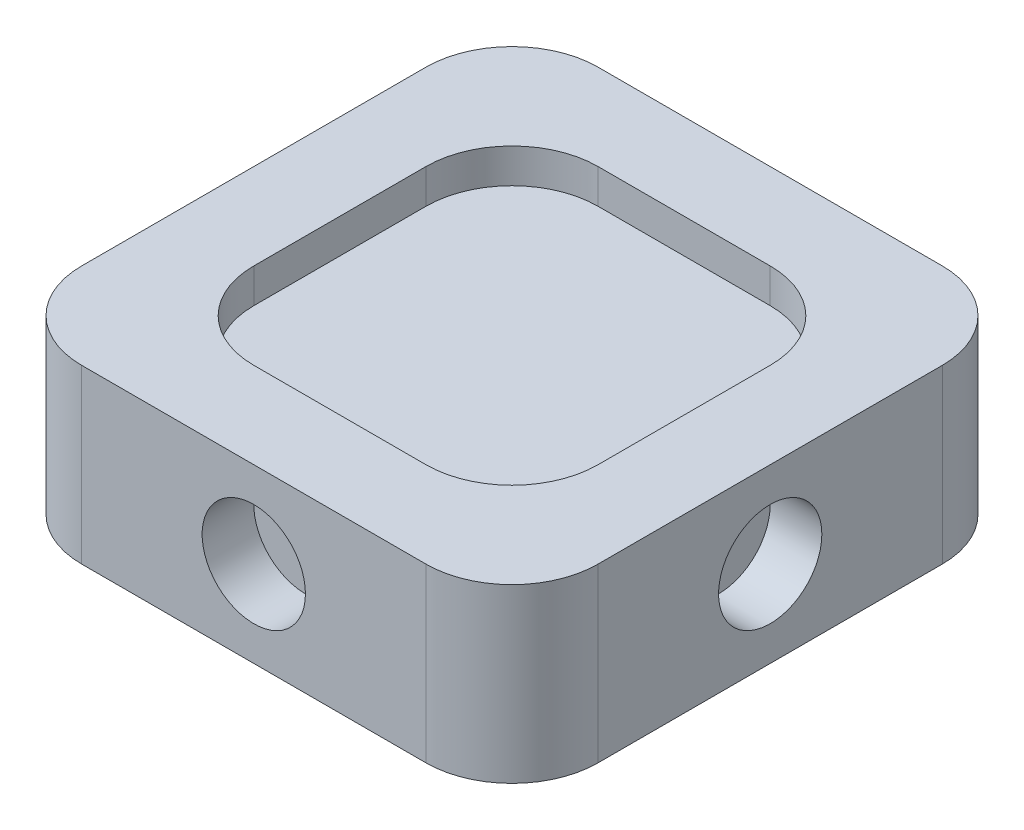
from build123d import *

# Parameters (mm, degrees)
SKETCH2_W           = 30
SKETCH2_H           = 30
BOSS_EXTRUDE1_DEPTH = 10
SKETCH3_R           = 3
CUT_EXTRUDE1_DEPTH  = 3
SKETCH4_R           = 3
CUT_EXTRUDE2_DEPTH  = 3
CUT_EXTRUDE3_START  = -3
SKETCH5_R           = 3
CUT_EXTRUDE3_DEPTH  = 3
CUT_EXTRUDE4_START  = -3
SKETCH6_R           = 3
CUT_EXTRUDE4_DEPTH  = 3
FILLET1_R           = 5
SKETCH8_W           = 20
SKETCH8_H           = 20
CUT_EXTRUDE6_DEPTH  = 2
FILLET2_R           = 5
SKETCH9_W           = 20
SKETCH9_H           = 20
CUT_EXTRUDE7_DEPTH  = 2
FILLET3_R           = 5


with BuildPart() as part:
    # Sketch2 → Boss-Extrude1 (new body)
    with BuildSketch(Plane(origin=(0, 0, 0), x_dir=(1, 0, 0), z_dir=(0, 1, 0))):
        Rectangle(SKETCH2_W, SKETCH2_H)
    extrude(amount=BOSS_EXTRUDE1_DEPTH)

    # Sketch3 → Cut-Extrude1 (cut)
    with BuildSketch(Plane.XY.offset(15)):
        with Locations((0, 5)):
            Circle(SKETCH3_R)
    extrude(amount=-CUT_EXTRUDE1_DEPTH, mode=Mode.SUBTRACT)

    # Sketch4 → Cut-Extrude2 (cut)
    with BuildSketch(Plane(origin=(15, 0, 0), x_dir=(0, 0, -1), z_dir=(1, 0, 0))):
        with Locations((0, 5)):
            Circle(SKETCH4_R)
    extrude(amount=-CUT_EXTRUDE2_DEPTH, mode=Mode.SUBTRACT)

    # Sketch5 → Cut-Extrude3 (cut)
    with BuildSketch(Plane(origin=(0, 0, -15), x_dir=(-1, 0, 0), z_dir=(0, 0, -1)).offset(CUT_EXTRUDE3_START)):
        with Locations(Location((0, 5, 0), (0, 0, 180))):
            Circle(SKETCH5_R)
    extrude(amount=CUT_EXTRUDE3_DEPTH, mode=Mode.SUBTRACT)

    # Sketch6 → Cut-Extrude4 (cut)
    with BuildSketch(Plane.ZY.offset(15).offset(CUT_EXTRUDE4_START)):
        with Locations(Location((0, 5, 0), (0, 0, 180))):
            Circle(SKETCH6_R)
    extrude(amount=CUT_EXTRUDE4_DEPTH, mode=Mode.SUBTRACT)

    # Fillet1
    fillet1_edges = [part.edges().sort_by_distance(p)[0] for p in [
        (15, 5, 15),
        (-15, 5, 15),
        (-15, 5, -15),
        (15, 5, -15),
    ]]
    fillet(fillet1_edges, radius=FILLET1_R)

    # Sketch8 → Cut-Extrude6 (cut)
    with BuildSketch(Plane(origin=(0, 10, 0), x_dir=(1, 0, 0), z_dir=(0, 1, 0))):
        Rectangle(SKETCH8_W, SKETCH8_H)
    extrude(amount=-CUT_EXTRUDE6_DEPTH, mode=Mode.SUBTRACT)

    # Fillet2
    fillet2_edges = [part.edges().sort_by_distance(p)[0] for p in [
        (10, 9, -10),
        (10, 9, 10),
        (-10, 9, 10),
        (-10, 9, -10),
    ]]
    fillet(fillet2_edges, radius=FILLET2_R)

    # Sketch9 → Cut-Extrude7 (cut)
    with BuildSketch(Plane(origin=(0, 0, 0), x_dir=(-1, 0, 0), z_dir=(0, -1, 0))):
        Rectangle(SKETCH9_W, SKETCH9_H)
    extrude(amount=-CUT_EXTRUDE7_DEPTH, mode=Mode.SUBTRACT)

    # Fillet3
    fillet3_edges = [part.edges().sort_by_distance(p)[0] for p in [
        (10, 1, 10),
        (10, 1, -10),
        (-10, 1, -10),
        (-10, 1, 10),
    ]]
    fillet(fillet3_edges, radius=FILLET3_R)


solid = part.part
